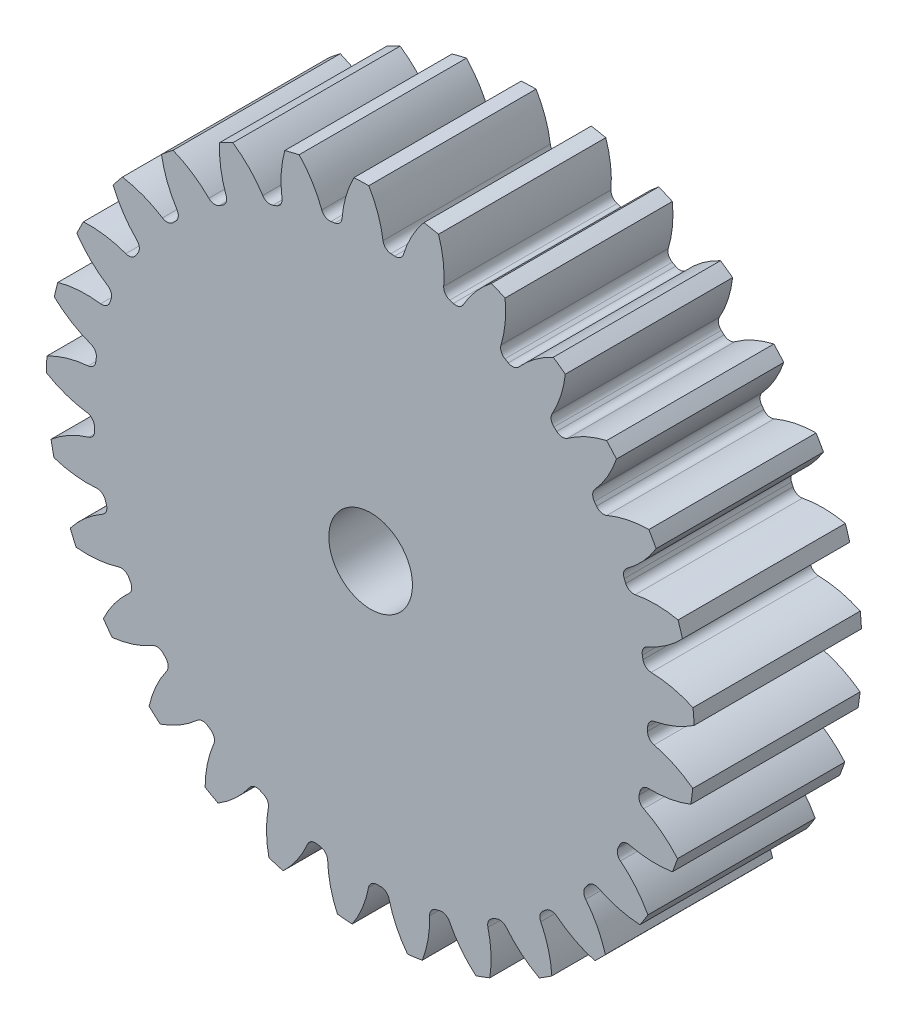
from build123d import *

# Parameters (mm, degrees)
SKETCH3_R         = 196.85
GEARBODY_DEPTH    = 101.6
TOOTHCUT_DEPTH    = 297.348451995
CIRPATTERN1_COUNT = 29
BOREDIA_R         = 25.4
BORE_DEPTH        = 12700


with BuildPart() as part:
    # Sketch3 → gearBody (new body)
    with BuildSketch(Plane.XY):
        Circle(SKETCH3_R)
    extrude(amount=GEARBODY_DEPTH)

    # Sketch2 → toothCut (cut, through all)
    with BuildSketch(Plane.XY):
        with BuildLine():
            ThreePointArc((168.186940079, -5.443235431), (168.220039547, -4.300455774), (168.245374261, -3.157477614))
            ThreePointArc((168.245374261, -3.157477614), (169.455095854, 0.069633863), (172.42452464, 1.818967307))
            ThreePointArc((172.42452464, 1.818967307), (185.156973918, 5.674621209), (196.85, 12.019262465))
            ThreePointArc((196.85, 12.019262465), (197.152181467, -5.040090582), (195.978737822, -22.061720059))
            ThreePointArc((195.978737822, -22.061720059), (184.625168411, -15.127904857), (172.106357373, -10.626715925))
            ThreePointArc((172.106357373, -10.626715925), (169.230190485, -8.727942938), (168.186940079, -5.443235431))
        make_face()
    toothcut = extrude(amount=TOOTHCUT_DEPTH, mode=Mode.SUBTRACT)

    # CirPattern1: toothCut ×29 about axis
    cirpattern1_axis = Axis((0, 0, 0), (0, 0, 1))
    for i in range(1, CIRPATTERN1_COUNT):
        add(toothcut.rotate(cirpattern1_axis, i * 360 / CIRPATTERN1_COUNT), mode=Mode.SUBTRACT)

    # boreDia → bore (cut, symmetric)
    with BuildSketch(Plane.XY):
        Circle(BOREDIA_R)
    extrude(amount=BORE_DEPTH, both=True, mode=Mode.SUBTRACT)


solid = part.part
